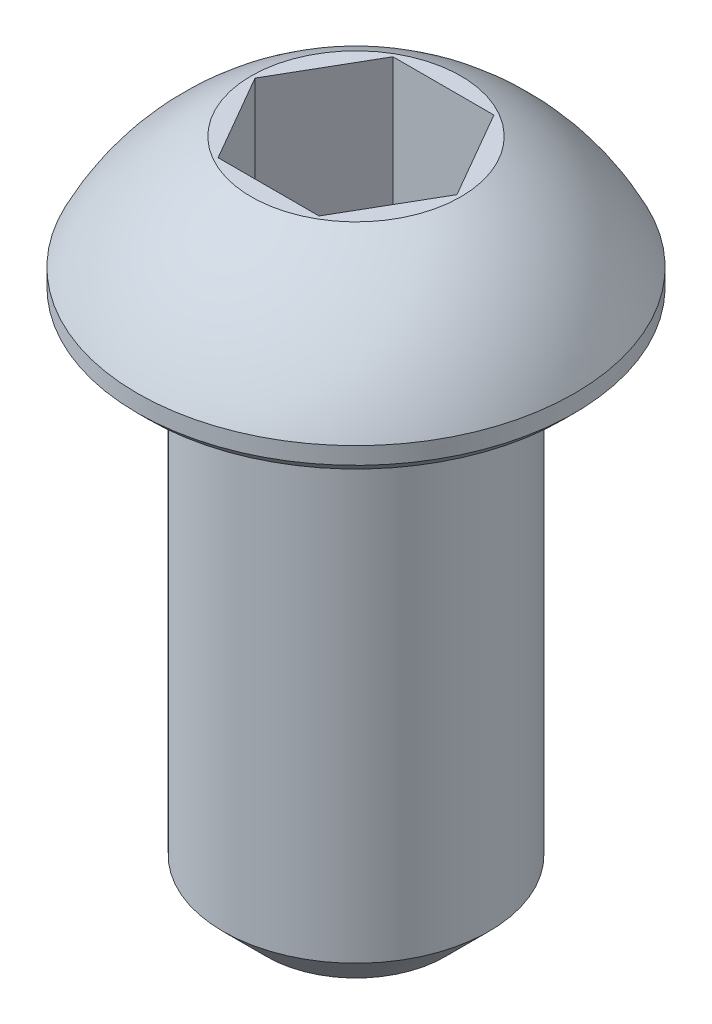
from build123d import *

# Parameters (mm, degrees)
CUT_EXTRUDE1_DEPTH = 2.38125
CHAMFER1_SIZE      = 0.1984375
CHAMFER2_SIZE      = 0.79375


with BuildPart() as part:
    # Sketch1 → Revolve1 (revolve)
    with BuildSketch(Plane.XY, mode=Mode.PRIVATE) as revolve1_sk:
        with BuildLine():
            Line((3.96875, 0.508), (3.96875, 0))
            Line((3.96875, 0), (2.413, 0))
            Line((2.413, 0), (2.413, -9.525))
            Line((2.413, -9.525), (0, -9.525))
            Line((0, -9.525), (0, 2.5654))
            Line((0, 2.5654), (1.90281307, 2.5654))
            ThreePointArc((1.90281307, 2.5654), (3.110793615, 1.712438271), (3.96875, 0.508))
        make_face()
    revolve(revolve1_sk.sketch.rotate(Axis((0, 0, 0), (0, -1, 0)), 90), axis=Axis((0, 0, 0), (0, -1, 0)))

    # Sketch2 → Cut-Extrude1 (cut)
    with BuildSketch(Plane(origin=(0, 2.5654, 0), x_dir=(1, 0, 0), z_dir=(0, 1, 0))):
        Polygon((-0.916543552, 1.5875), (0.916543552, 1.5875), (1.833087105, 0), (0.916543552, -1.5875), (-0.916543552, -1.5875), (-1.833087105, 0), align=None)
    extrude(amount=-CUT_EXTRUDE1_DEPTH, mode=Mode.SUBTRACT)

    # Chamfer1
    chamfer1_edges = [part.edges().sort_by_distance(p)[0] for p in [
        (0, 0, -3.96875),
    ]]
    chamfer(chamfer1_edges, length=CHAMFER1_SIZE)

    # Chamfer2
    chamfer2_edges = [part.edges().sort_by_distance(p)[0] for p in [
        (0, -9.525, -2.413),
    ]]
    chamfer(chamfer2_edges, length=CHAMFER2_SIZE)


solid = part.part
